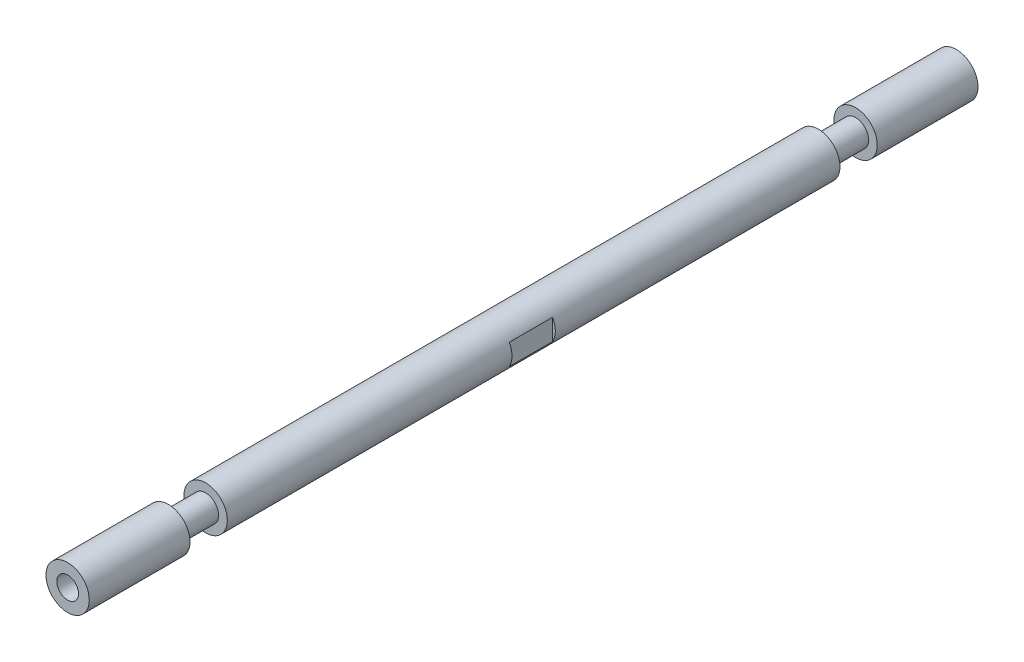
from build123d import *

# Parameters (mm, degrees)
SKETCH1_R          = 6.35
BASE_EXTRUDE_DEPTH = 260.477
SKETCH2_R          = 7.035220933
SKETCH2_R_2        = 3.81
CUT_EXTRUDE1_DEPTH = 10.922
SKETCH3_R          = 6.779676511
SKETCH3_R_2        = 3.829900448
CUT_EXTRUDE2_DEPTH = 10.922
SKETCH12_W         = 0.8001
SKETCH12_H         = 12.7
CUT_EXTRUDE3_DEPTH = 12.7


with BuildPart() as part:
    # Sketch1 → Base-Extrude (new body)
    with BuildSketch(Plane.XY):
        Circle(SKETCH1_R)
    extrude(amount=BASE_EXTRUDE_DEPTH)

    # Sketch2 → Cut-Extrude1 (cut)
    with BuildSketch(Plane.XY.offset(230.9495)):
        Circle(SKETCH2_R)
        Circle(SKETCH2_R_2, mode=Mode.SUBTRACT)
    extrude(amount=-CUT_EXTRUDE1_DEPTH, mode=Mode.SUBTRACT)

    # Sketch3 → Cut-Extrude2 (cut)
    with BuildSketch(Plane(origin=(0, 0, 29.5275), x_dir=(-1, 0, 0), z_dir=(0, 0, -1))):
        Circle(SKETCH3_R)
        Circle(SKETCH3_R_2, mode=Mode.SUBTRACT)
    extrude(amount=-CUT_EXTRUDE2_DEPTH, mode=Mode.SUBTRACT)

    # Sketch4 → 1_4-20 Tapped Hole 1 (revolve, cut)
    with BuildSketch(Plane(origin=(0.003085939, -0.011311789, 0), x_dir=(0, 1, 0), z_dir=(1, 0, 0))):
        Polygon((0, 0), (0, 25.399978), (2.552697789, 23.866162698), (2.552697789, 0.002539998), (2.552697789, 0), align=None)
    revolve(axis=Axis((0.003085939, -0.011311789, 0), (0, 0, 1)), mode=Mode.SUBTRACT)

    # Sketch10 → 1_4-20 Tapped Hole 4 (revolve, cut)
    with BuildSketch(Plane(origin=(0.01449438, 0.004571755, 260.477), x_dir=(0, -1, 0), z_dir=(1, 0, 0))):
        Polygon((0, 0), (0, 12.699989), (2.552697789, 11.166173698), (2.552697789, 11.4299901), (3.17499725, 11.4299901), (3.17499725, 0.002539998), (3.17499725, 0), align=None)
    revolve(axis=Axis((0.01449438, 0.004571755, 260.477), (0, 0, -1)), mode=Mode.SUBTRACT)

    # Sketch12 → Cut-Extrude3 (cut, symmetric)
    with BuildSketch(Plane(origin=(0, 0, 0), x_dir=(1, 0, 0), z_dir=(0, 1, 0))):
        with Locations((-5.94995, -130.2385)):
            Rectangle(SKETCH12_W, SKETCH12_H)
    cut_extrude3 = extrude(amount=CUT_EXTRUDE3_DEPTH, both=True, mode=Mode.SUBTRACT)

    # Mirror1: Cut-Extrude3 across plane
    add(cut_extrude3.mirror(Plane(origin=(0, 0, 0), x_dir=(0, 0, 1), z_dir=(1, 0, 0))), mode=Mode.SUBTRACT)


solid = part.part
